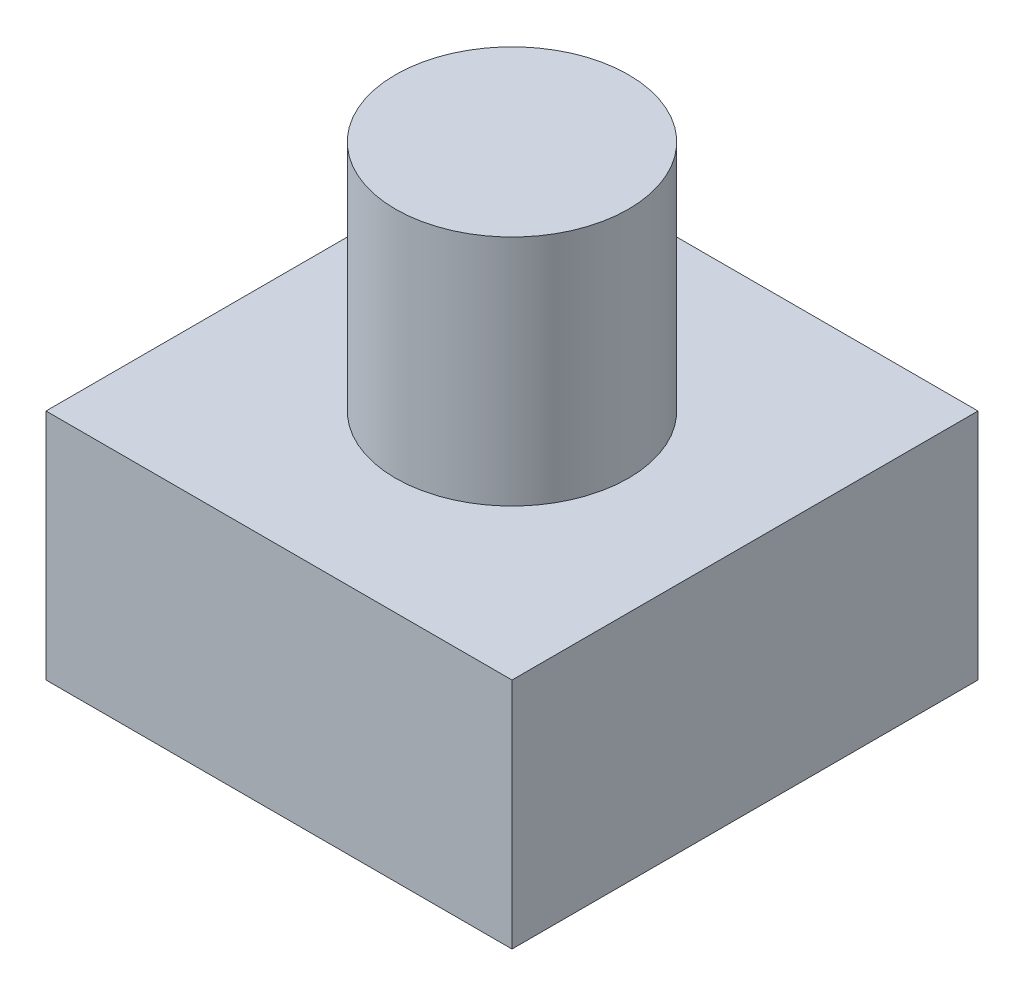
from build123d import *

# Parameters (mm, degrees)
SKETCH1_W      = 100
SKETCH1_H      = 100
EXTRUDE1_DEPTH = 50
SKETCH2_R      = 25
EXTRUDE2_DEPTH = 50


with BuildPart() as part:
    # Sketch1 → Extrude1 (new body)
    with BuildSketch(Plane(origin=(0, 0, 0), x_dir=(1, 0, 0), z_dir=(0, 1, 0))):
        with Locations((-50, 50)):
            Rectangle(SKETCH1_W, SKETCH1_H)
    extrude(amount=EXTRUDE1_DEPTH)

    # Sketch2 → Extrude2 (add)
    with BuildSketch(Plane(origin=(0, 50, 0), x_dir=(-1, 0, 0), z_dir=(0, 1, 0))):
        with Locations(Location((50, -50, 0), (0, 0, 90))):
            Circle(SKETCH2_R)
    extrude(amount=EXTRUDE2_DEPTH)


solid = part.part
